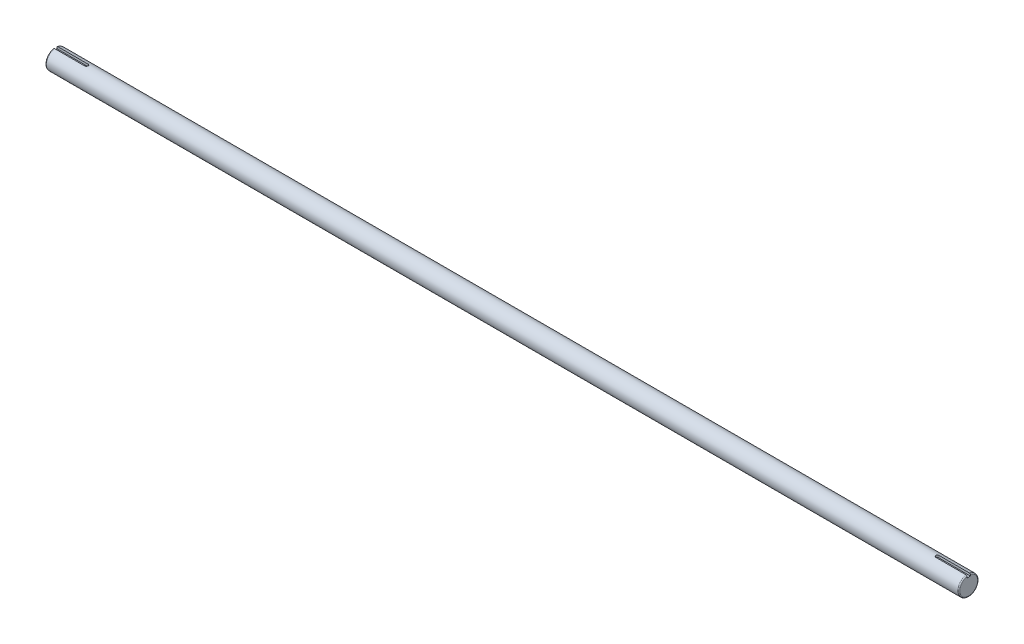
ISO-10303-21;
HEADER;
FILE_DESCRIPTION(('STEP AP214'),'2;1');
FILE_NAME('part.step','',(''),(''),'','','');
FILE_SCHEMA(('AUTOMOTIVE_DESIGN { 1 0 10303 214 1 1 1 1 }'));
ENDSEC;
DATA;
#1=APPLICATION_CONTEXT('core data for automotive mechanical design processes');
#2=APPLICATION_PROTOCOL_DEFINITION('international standard','automotive_design',2000,#1);
#3=PRODUCT_CONTEXT('',#1,'mechanical');
#4=PRODUCT('Part','Part','',(#3));
#5=PRODUCT_RELATED_PRODUCT_CATEGORY('part','',(#4));
#6=PRODUCT_DEFINITION_FORMATION('','',#4);
#7=PRODUCT_DEFINITION_CONTEXT('part definition',#1,'design');
#8=PRODUCT_DEFINITION('design','',#6,#7);
#9=PRODUCT_DEFINITION_SHAPE('','',#8);
#10=(LENGTH_UNIT() NAMED_UNIT(*) SI_UNIT(.MILLI.,.METRE.));
#11=(NAMED_UNIT(*) PLANE_ANGLE_UNIT() SI_UNIT($,.RADIAN.));
#12=(NAMED_UNIT(*) SI_UNIT($,.STERADIAN.) SOLID_ANGLE_UNIT());
#13=UNCERTAINTY_MEASURE_WITH_UNIT(LENGTH_MEASURE(1.E-05),#10,'distance_accuracy_value','');
#14=(GEOMETRIC_REPRESENTATION_CONTEXT(3) GLOBAL_UNCERTAINTY_ASSIGNED_CONTEXT((#13)) GLOBAL_UNIT_ASSIGNED_CONTEXT((#10,
#11,#12)) REPRESENTATION_CONTEXT('',''));
#15=CARTESIAN_POINT('',(0.,0.,0.));
#16=DIRECTION('',(0.,0.,1.));
#17=DIRECTION('',(1.,0.,0.));
#18=AXIS2_PLACEMENT_3D('',#15,#16,#17);
#19=CARTESIAN_POINT('',(353.06,0.,0.));
#20=DIRECTION('',(-1.,0.,0.));
#21=DIRECTION('',(0.,0.,1.));
#22=AXIS2_PLACEMENT_3D('',#19,#20,#21);
#23=CYLINDRICAL_SURFACE('',#22,7.62);
#24=DIRECTION('',(-1.,0.,0.));
#25=VECTOR('',#24,1.);
#26=CARTESIAN_POINT('',(353.06,7.51342132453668,1.26999999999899));
#27=LINE('',#26,#25);
#28=CARTESIAN_POINT('',(352.298,7.51342132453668,1.26999999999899));
#29=VERTEX_POINT('',#28);
#30=CARTESIAN_POINT('',(328.93,7.51342132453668,1.26999999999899));
#31=VERTEX_POINT('',#30);
#32=EDGE_CURVE('E64',#29,#31,#27,.T.);
#33=ORIENTED_EDGE('',*,*,#32,.T.);
#34=CARTESIAN_POINT('',(328.93,7.51342132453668,1.26999999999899));
#35=CARTESIAN_POINT('',(328.859197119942,7.51342260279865,1.26999715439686));
#36=CARTESIAN_POINT('',(328.788355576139,7.51443299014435,1.26405902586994));
#37=CARTESIAN_POINT('',(328.648660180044,7.51836168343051,1.24047373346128));
#38=CARTESIAN_POINT('',(328.579808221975,7.52128174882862,1.22281577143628));
#39=CARTESIAN_POINT('',(328.446133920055,7.52869009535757,1.17633980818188));
#40=CARTESIAN_POINT('',(328.381308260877,7.53317706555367,1.14753113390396));
#41=CARTESIAN_POINT('',(328.257417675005,7.54321210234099,1.07959474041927));
#42=CARTESIAN_POINT('',(328.198352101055,7.54876004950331,1.04046818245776));
#43=CARTESIAN_POINT('',(328.087069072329,7.56035303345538,0.95259526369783));
#44=CARTESIAN_POINT('',(328.034916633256,7.56640202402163,0.903767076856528));
#45=CARTESIAN_POINT('',(327.939505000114,7.57828040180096,0.798053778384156));
#46=CARTESIAN_POINT('',(327.896246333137,7.58410977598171,0.741168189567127));
#47=CARTESIAN_POINT('',(327.819606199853,7.59493394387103,0.620533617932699));
#48=CARTESIAN_POINT('',(327.786285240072,7.59992354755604,0.556745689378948));
#49=CARTESIAN_POINT('',(327.73085529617,7.6084619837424,0.424380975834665));
#50=CARTESIAN_POINT('',(327.708745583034,7.61201090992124,0.355804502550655));
#51=CARTESIAN_POINT('',(327.676564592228,7.61724021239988,0.216481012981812));
#52=CARTESIAN_POINT('',(327.66638407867,7.61893753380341,0.145759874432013));
#53=CARTESIAN_POINT('',(327.65801079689,7.62033060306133,0.00359424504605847));
#54=CARTESIAN_POINT('',(327.659817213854,7.62002648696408,-0.0678501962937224));
#55=CARTESIAN_POINT('',(327.675281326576,7.61746436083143,-0.208687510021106));
#56=CARTESIAN_POINT('',(327.688821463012,7.61522573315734,-0.278093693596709));
#57=CARTESIAN_POINT('',(327.727183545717,7.60906773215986,-0.413634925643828));
#58=CARTESIAN_POINT('',(327.752005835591,7.60514830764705,-0.479769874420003));
#59=CARTESIAN_POINT('',(327.81234444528,7.59603610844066,-0.60724092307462));
#60=CARTESIAN_POINT('',(327.847909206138,7.59083758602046,-0.668553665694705));
#61=CARTESIAN_POINT('',(327.928687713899,7.57974474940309,-0.784385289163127));
#62=CARTESIAN_POINT('',(327.973902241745,7.57385037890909,-0.838903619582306));
#63=CARTESIAN_POINT('',(328.073348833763,7.56193696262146,-0.940293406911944));
#64=CARTESIAN_POINT('',(328.12768364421,7.55591727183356,-0.987064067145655));
#65=CARTESIAN_POINT('',(328.24348224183,7.54450083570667,-1.07084093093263));
#66=CARTESIAN_POINT('',(328.304946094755,7.53910409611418,-1.10784704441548));
#67=CARTESIAN_POINT('',(328.433374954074,7.52954427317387,-1.17106417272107));
#68=CARTESIAN_POINT('',(328.500346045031,7.52538257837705,-1.19726304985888));
#69=CARTESIAN_POINT('',(328.637823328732,7.51878703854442,-1.23801117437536));
#70=CARTESIAN_POINT('',(328.708329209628,7.5163530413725,-1.25256144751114));
#71=CARTESIAN_POINT('',(328.84997280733,7.51351791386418,-1.26945739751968));
#72=CARTESIAN_POINT('',(328.921092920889,7.51309285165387,-1.27194676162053));
#73=CARTESIAN_POINT('',(329.062733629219,7.51425997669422,-1.2650331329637));
#74=CARTESIAN_POINT('',(329.133254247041,7.51585208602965,-1.25563059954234));
#75=CARTESIAN_POINT('',(329.271237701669,7.52085205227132,-1.22532258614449));
#76=CARTESIAN_POINT('',(329.338717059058,7.52424835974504,-1.20449024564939));
#77=CARTESIAN_POINT('',(329.46922684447,7.53246435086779,-1.15199068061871));
#78=CARTESIAN_POINT('',(329.532257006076,7.53728411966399,-1.12032280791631));
#79=CARTESIAN_POINT('',(329.652718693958,7.54785957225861,-1.04671199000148));
#80=CARTESIAN_POINT('',(329.71009321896,7.55362347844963,-1.00467696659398));
#81=CARTESIAN_POINT('',(329.817025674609,7.5654137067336,-0.91165144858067));
#82=CARTESIAN_POINT('',(329.866583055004,7.57144004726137,-0.860660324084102));
#83=CARTESIAN_POINT('',(329.956999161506,7.58315182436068,-0.750533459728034));
#84=CARTESIAN_POINT('',(329.997762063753,7.58883306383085,-0.691318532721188));
#85=CARTESIAN_POINT('',(330.068760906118,7.59914717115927,-0.566797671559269));
#86=CARTESIAN_POINT('',(330.098997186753,7.60378007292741,-0.501491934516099));
#87=CARTESIAN_POINT('',(330.147935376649,7.61145725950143,-0.366927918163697));
#88=CARTESIAN_POINT('',(330.166687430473,7.61450844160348,-0.297688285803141));
#89=CARTESIAN_POINT('',(330.192286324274,7.61870756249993,-0.156987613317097));
#90=CARTESIAN_POINT('',(330.199134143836,7.61985565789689,-0.0855267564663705));
#91=CARTESIAN_POINT('',(330.200701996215,7.62011703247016,0.0566629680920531));
#92=CARTESIAN_POINT('',(330.195567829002,7.61925477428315,0.127390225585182));
#93=CARTESIAN_POINT('',(330.173632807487,7.61564226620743,0.266960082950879));
#94=CARTESIAN_POINT('',(330.156832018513,7.61289202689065,0.335802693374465));
#95=CARTESIAN_POINT('',(330.112096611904,7.60581150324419,0.46959339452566));
#96=CARTESIAN_POINT('',(330.084174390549,7.60148297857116,0.534545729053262));
#97=CARTESIAN_POINT('',(330.018004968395,7.59171840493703,0.658866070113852));
#98=CARTESIAN_POINT('',(329.979757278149,7.58628230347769,0.718233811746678));
#99=CARTESIAN_POINT('',(329.893505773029,7.57482675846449,0.830434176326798));
#100=CARTESIAN_POINT('',(329.845395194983,7.56880134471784,0.883184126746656));
#101=CARTESIAN_POINT('',(329.741007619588,7.55688762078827,0.979913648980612));
#102=CARTESIAN_POINT('',(329.684728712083,7.55099934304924,1.02389116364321));
#103=CARTESIAN_POINT('',(329.565129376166,7.53998158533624,1.10211324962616));
#104=CARTESIAN_POINT('',(329.501761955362,7.53485776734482,1.13628677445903));
#105=CARTESIAN_POINT('',(329.370126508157,7.52601598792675,1.19345178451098));
#106=CARTESIAN_POINT('',(329.30186345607,7.52229662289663,1.21645444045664));
#107=CARTESIAN_POINT('',(329.182778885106,7.51750970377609,1.24562923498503));
#108=CARTESIAN_POINT('',(329.132678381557,7.51598508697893,1.25475360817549));
#109=CARTESIAN_POINT('',(329.031725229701,7.51394044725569,1.26693995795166));
#110=CARTESIAN_POINT('',(328.980872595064,7.51342040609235,1.27000204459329));
#111=CARTESIAN_POINT('',(328.93,7.51342132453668,1.26999999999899));
#112=B_SPLINE_CURVE_WITH_KNOTS('',3,(#34,#35,#36,#37,#38,#39,#40,#41,#42,#43,#44,#45,#46,#47,
#48,#49,#50,#51,#52,#53,#54,#55,#56,#57,#58,#59,#60,#61,#62,#63,#64,#65,#66,#67,#68,#69,#70,#71,
#72,#73,#74,#75,#76,#77,#78,#79,#80,#81,#82,#83,#84,#85,#86,#87,#88,#89,#90,#91,#92,#93,#94,#95,
#96,#97,#98,#99,#100,#101,#102,#103,#104,#105,#106,#107,#108,#109,#110,#111),.UNSPECIFIED.,.T.,
.F.,(4,2,2,2,2,2,2,2,2,2,2,2,2,2,2,2,2,2,2,2,2,2,2,2,2,2,2,2,2,2,2,2,2,2,2,2,2,2,4),(0.,
0.212222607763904,0.424641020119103,0.636882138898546,0.849099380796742,1.06318892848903,
1.27729116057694,1.49267153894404,1.70803791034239,1.92141636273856,2.13478031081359,
2.34603097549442,2.55728807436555,2.76951238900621,2.98175388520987,3.1965703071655,
3.41138871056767,3.62644772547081,3.84148780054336,4.05395959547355,4.2664231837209,
4.47754280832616,4.6886750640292,4.90175470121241,5.11484933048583,5.33016009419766,
5.54546389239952,5.75982076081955,5.97415998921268,6.18590470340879,6.39764823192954,
6.60915640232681,6.82067460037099,7.03461634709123,7.24860820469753,7.46411373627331,
7.67940331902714,7.83189020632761,7.98437432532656),.UNSPECIFIED.);
#113=CARTESIAN_POINT('',(328.93,7.51342132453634,-1.27000000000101));
#114=VERTEX_POINT('',#113);
#115=EDGE_CURVE('E13',#31,#114,#112,.T.);
#116=ORIENTED_EDGE('',*,*,#115,.T.);
#117=DIRECTION('',(-1.,0.,0.));
#118=VECTOR('',#117,1.);
#119=CARTESIAN_POINT('',(353.06,7.51342132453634,-1.27000000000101));
#120=LINE('',#119,#118);
#121=CARTESIAN_POINT('',(352.298,7.51342132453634,-1.27000000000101));
#122=VERTEX_POINT('',#121);
#123=EDGE_CURVE('E157',#114,#122,#120,.F.);
#124=ORIENTED_EDGE('',*,*,#123,.T.);
#125=CARTESIAN_POINT('',(352.298,0.,0.));
#126=DIRECTION('',(1.,0.,0.));
#127=DIRECTION('',(0.,0.,-1.));
#128=AXIS2_PLACEMENT_3D('',#125,#126,#127);
#129=CIRCLE('',#128,7.62);
#130=EDGE_CURVE('E191',#122,#29,#129,.F.);
#131=ORIENTED_EDGE('',*,*,#130,.T.);
#132=EDGE_LOOP('',(#33,#116,#124,#131));
#133=FACE_BOUND('',#132,.T.);
#134=DIRECTION('',(-1.,0.,0.));
#135=VECTOR('',#134,1.);
#136=CARTESIAN_POINT('',(353.06,7.51342132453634,-1.270000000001));
#137=LINE('',#136,#135);
#138=CARTESIAN_POINT('',(-352.298,7.51342132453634,-1.27000000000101));
#139=VERTEX_POINT('',#138);
#140=CARTESIAN_POINT('',(-328.93,7.51342132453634,-1.27000000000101));
#141=VERTEX_POINT('',#140);
#142=EDGE_CURVE('E72',#139,#141,#137,.F.);
#143=ORIENTED_EDGE('',*,*,#142,.T.);
#144=CARTESIAN_POINT('',(-328.93,7.51342132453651,1.27));
#145=CARTESIAN_POINT('',(-329.000802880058,7.51342260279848,1.26999715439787));
#146=CARTESIAN_POINT('',(-329.071644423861,7.51443299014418,1.26405902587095));
#147=CARTESIAN_POINT('',(-329.211339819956,7.51836168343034,1.24047373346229));
#148=CARTESIAN_POINT('',(-329.280191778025,7.52128174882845,1.2228157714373));
#149=CARTESIAN_POINT('',(-329.413866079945,7.52869009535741,1.1763398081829));
#150=CARTESIAN_POINT('',(-329.478691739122,7.53317706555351,1.14753113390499));
#151=CARTESIAN_POINT('',(-329.602582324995,7.54321210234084,1.07959474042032));
#152=CARTESIAN_POINT('',(-329.661647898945,7.54876004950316,1.04046818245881));
#153=CARTESIAN_POINT('',(-329.772930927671,7.56035303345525,0.952595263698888));
#154=CARTESIAN_POINT('',(-329.825083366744,7.56640202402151,0.903767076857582));
#155=CARTESIAN_POINT('',(-329.920494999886,7.57828040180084,0.798053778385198));
#156=CARTESIAN_POINT('',(-329.963753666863,7.58410977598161,0.74116818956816));
#157=CARTESIAN_POINT('',(-330.040393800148,7.59493394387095,0.620533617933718));
#158=CARTESIAN_POINT('',(-330.073714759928,7.59992354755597,0.556745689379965));
#159=CARTESIAN_POINT('',(-330.12914470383,7.60846198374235,0.424380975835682));
#160=CARTESIAN_POINT('',(-330.151254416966,7.61201090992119,0.355804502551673));
#161=CARTESIAN_POINT('',(-330.183435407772,7.61724021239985,0.21648101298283));
#162=CARTESIAN_POINT('',(-330.19361592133,7.6189375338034,0.145759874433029));
#163=CARTESIAN_POINT('',(-330.20198920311,7.62033060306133,0.00359424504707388));
#164=CARTESIAN_POINT('',(-330.200182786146,7.62002648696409,-0.0678501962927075));
#165=CARTESIAN_POINT('',(-330.184718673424,7.61746436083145,-0.208687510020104));
#166=CARTESIAN_POINT('',(-330.171178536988,7.61522573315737,-0.278093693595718));
#167=CARTESIAN_POINT('',(-330.132816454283,7.60906773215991,-0.413634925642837));
#168=CARTESIAN_POINT('',(-330.107994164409,7.60514830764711,-0.479769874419));
#169=CARTESIAN_POINT('',(-330.04765555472,7.59603610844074,-0.607240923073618));
#170=CARTESIAN_POINT('',(-330.012090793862,7.59083758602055,-0.668553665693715));
#171=CARTESIAN_POINT('',(-329.931312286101,7.5797447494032,-0.784385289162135));
#172=CARTESIAN_POINT('',(-329.886097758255,7.5738503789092,-0.838903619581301));
#173=CARTESIAN_POINT('',(-329.786651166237,7.56193696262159,-0.940293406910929));
#174=CARTESIAN_POINT('',(-329.73231635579,7.55591727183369,-0.987064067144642));
#175=CARTESIAN_POINT('',(-329.61651775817,7.54450083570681,-1.07084093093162));
#176=CARTESIAN_POINT('',(-329.555053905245,7.53910409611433,-1.10784704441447));
#177=CARTESIAN_POINT('',(-329.426625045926,7.52954427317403,-1.17106417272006));
#178=CARTESIAN_POINT('',(-329.359653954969,7.52538257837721,-1.19726304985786));
#179=CARTESIAN_POINT('',(-329.222176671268,7.51878703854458,-1.23801117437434));
#180=CARTESIAN_POINT('',(-329.151670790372,7.51635304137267,-1.25256144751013));
#181=CARTESIAN_POINT('',(-329.01002719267,7.51351791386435,-1.26945739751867));
#182=CARTESIAN_POINT('',(-328.938907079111,7.51309285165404,-1.27194676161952));
#183=CARTESIAN_POINT('',(-328.797266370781,7.51425997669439,-1.26503313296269));
#184=CARTESIAN_POINT('',(-328.726745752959,7.51585208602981,-1.25563059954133));
#185=CARTESIAN_POINT('',(-328.588762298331,7.52085205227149,-1.22532258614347));
#186=CARTESIAN_POINT('',(-328.521282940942,7.52424835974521,-1.20449024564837));
#187=CARTESIAN_POINT('',(-328.39077315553,7.53246435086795,-1.15199068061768));
#188=CARTESIAN_POINT('',(-328.327742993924,7.53728411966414,-1.12032280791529));
#189=CARTESIAN_POINT('',(-328.207281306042,7.54785957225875,-1.04671199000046));
#190=CARTESIAN_POINT('',(-328.14990678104,7.55362347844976,-1.00467696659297));
#191=CARTESIAN_POINT('',(-328.042974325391,7.56541370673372,-0.911651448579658));
#192=CARTESIAN_POINT('',(-327.993416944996,7.57144004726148,-0.860660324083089));
#193=CARTESIAN_POINT('',(-327.903000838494,7.58315182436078,-0.75053345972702));
#194=CARTESIAN_POINT('',(-327.862237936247,7.58883306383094,-0.691318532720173));
#195=CARTESIAN_POINT('',(-327.791239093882,7.59914717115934,-0.566797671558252));
#196=CARTESIAN_POINT('',(-327.761002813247,7.60378007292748,-0.501491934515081));
#197=CARTESIAN_POINT('',(-327.712064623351,7.61145725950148,-0.366927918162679));
#198=CARTESIAN_POINT('',(-327.693312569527,7.61450844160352,-0.297688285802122));
#199=CARTESIAN_POINT('',(-327.667713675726,7.61870756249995,-0.156987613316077));
#200=CARTESIAN_POINT('',(-327.660865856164,7.6198556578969,-0.0855267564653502));
#201=CARTESIAN_POINT('',(-327.659298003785,7.62011703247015,0.0566629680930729));
#202=CARTESIAN_POINT('',(-327.664432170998,7.61925477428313,0.127390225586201));
#203=CARTESIAN_POINT('',(-327.686367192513,7.61564226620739,0.266960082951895));
#204=CARTESIAN_POINT('',(-327.703167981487,7.61289202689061,0.335802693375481));
#205=CARTESIAN_POINT('',(-327.747903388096,7.60581150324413,0.469593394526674));
#206=CARTESIAN_POINT('',(-327.775825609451,7.60148297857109,0.534545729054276));
#207=CARTESIAN_POINT('',(-327.841995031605,7.59171840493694,0.658866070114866));
#208=CARTESIAN_POINT('',(-327.880242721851,7.58628230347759,0.718233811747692));
#209=CARTESIAN_POINT('',(-327.966494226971,7.57482675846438,0.830434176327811));
#210=CARTESIAN_POINT('',(-328.014604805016,7.56880134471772,0.883184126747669));
#211=CARTESIAN_POINT('',(-328.118992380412,7.55688762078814,0.979913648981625));
#212=CARTESIAN_POINT('',(-328.175271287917,7.5509993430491,1.02389116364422));
#213=CARTESIAN_POINT('',(-328.294870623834,7.53998158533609,1.10211324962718));
#214=CARTESIAN_POINT('',(-328.358238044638,7.53485776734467,1.13628677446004));
#215=CARTESIAN_POINT('',(-328.489873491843,7.52601598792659,1.19345178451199));
#216=CARTESIAN_POINT('',(-328.55813654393,7.52229662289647,1.21645444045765));
#217=CARTESIAN_POINT('',(-328.677221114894,7.51750970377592,1.24562923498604));
#218=CARTESIAN_POINT('',(-328.727321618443,7.51598508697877,1.2547536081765));
#219=CARTESIAN_POINT('',(-328.828274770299,7.51394044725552,1.26693995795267));
#220=CARTESIAN_POINT('',(-328.879127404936,7.51342040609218,1.2700020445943));
#221=CARTESIAN_POINT('',(-328.93,7.51342132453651,1.27));
#222=B_SPLINE_CURVE_WITH_KNOTS('',3,(#144,#145,#146,#147,#148,#149,#150,#151,#152,#153,#154,
#155,#156,#157,#158,#159,#160,#161,#162,#163,#164,#165,#166,#167,#168,#169,#170,#171,#172,#173,
#174,#175,#176,#177,#178,#179,#180,#181,#182,#183,#184,#185,#186,#187,#188,#189,#190,#191,#192,
#193,#194,#195,#196,#197,#198,#199,#200,#201,#202,#203,#204,#205,#206,#207,#208,#209,#210,#211,
#212,#213,#214,#215,#216,#217,#218,#219,#220,#221),.UNSPECIFIED.,.T.,.F.,(4,2,2,2,2,2,2,2,2,2,2,
2,2,2,2,2,2,2,2,2,2,2,2,2,2,2,2,2,2,2,2,2,2,2,2,2,2,2,4),(0.,0.212222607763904,
0.424641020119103,0.636882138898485,0.849099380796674,1.06318892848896,1.27729116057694,
1.49267153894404,1.70803791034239,1.92141636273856,2.1347803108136,2.34603097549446,
2.55728807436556,2.76951238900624,2.98175388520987,3.19657030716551,3.41138871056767,
3.62644772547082,3.84148780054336,4.05395959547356,4.2664231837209,4.47754280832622,
4.6886750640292,4.90175470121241,5.11484933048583,5.33016009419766,5.54546389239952,
5.75982076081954,5.97415998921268,6.18590470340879,6.39764823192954,6.60915640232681,
6.82067460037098,7.03461634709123,7.24860820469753,7.46411373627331,7.67940331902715,
7.83189020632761,7.98437432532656),.UNSPECIFIED.);
#223=CARTESIAN_POINT('',(-328.93,7.51342132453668,1.26999999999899));
#224=VERTEX_POINT('',#223);
#225=EDGE_CURVE('E222',#141,#224,#222,.T.);
#226=ORIENTED_EDGE('',*,*,#225,.T.);
#227=DIRECTION('',(-1.,0.,0.));
#228=VECTOR('',#227,1.);
#229=CARTESIAN_POINT('',(353.06,7.51342132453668,1.26999999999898));
#230=LINE('',#229,#228);
#231=CARTESIAN_POINT('',(-352.298,7.51342132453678,1.26999999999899));
#232=VERTEX_POINT('',#231);
#233=EDGE_CURVE('E182',#224,#232,#230,.T.);
#234=ORIENTED_EDGE('',*,*,#233,.T.);
#235=CARTESIAN_POINT('',(-352.298,0.,0.));
#236=DIRECTION('',(1.,0.,0.));
#237=DIRECTION('',(0.,0.,-1.));
#238=AXIS2_PLACEMENT_3D('',#235,#236,#237);
#239=CIRCLE('',#238,7.62);
#240=EDGE_CURVE('E188',#232,#139,#239,.T.);
#241=ORIENTED_EDGE('',*,*,#240,.T.);
#242=EDGE_LOOP('',(#143,#226,#234,#241));
#243=FACE_BOUND('',#242,.T.);
#244=ADVANCED_FACE('F44',(#133,#243),#23,.T.);
#245=CARTESIAN_POINT('',(353.06,0.,0.));
#246=DIRECTION('',(1.,0.,0.));
#247=DIRECTION('',(0.,0.,-1.));
#248=AXIS2_PLACEMENT_3D('',#245,#246,#247);
#249=PLANE('',#248);
#250=DIRECTION('',(0.,1.,0.));
#251=VECTOR('',#250,1.);
#252=CARTESIAN_POINT('',(353.06,5.8039,-1.27000000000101));
#253=LINE('',#252,#251);
#254=CARTESIAN_POINT('',(353.06,5.8039,-1.27000000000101));
#255=VERTEX_POINT('',#254);
#256=CARTESIAN_POINT('',(353.06,6.73938157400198,-1.27000000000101));
#257=VERTEX_POINT('',#256);
#258=EDGE_CURVE('E153',#255,#257,#253,.T.);
#259=ORIENTED_EDGE('',*,*,#258,.F.);
#260=DIRECTION('',(0.,0.,-1.));
#261=VECTOR('',#260,1.);
#262=CARTESIAN_POINT('',(353.06,5.8039,1.26999999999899));
#263=LINE('',#262,#261);
#264=CARTESIAN_POINT('',(353.06,5.8039,1.26999999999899));
#265=VERTEX_POINT('',#264);
#266=EDGE_CURVE('E143',#265,#255,#263,.T.);
#267=ORIENTED_EDGE('',*,*,#266,.F.);
#268=DIRECTION('',(0.,1.,0.));
#269=VECTOR('',#268,1.);
#270=CARTESIAN_POINT('',(353.06,5.8039,1.26999999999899));
#271=LINE('',#270,#269);
#272=CARTESIAN_POINT('',(353.06,6.73938157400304,1.26999999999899));
#273=VERTEX_POINT('',#272);
#274=EDGE_CURVE('E134',#265,#273,#271,.T.);
#275=ORIENTED_EDGE('',*,*,#274,.T.);
#276=CARTESIAN_POINT('',(353.06,0.,0.));
#277=DIRECTION('',(1.,0.,0.));
#278=DIRECTION('',(0.,0.,-1.));
#279=AXIS2_PLACEMENT_3D('',#276,#277,#278);
#280=CIRCLE('',#279,6.858);
#281=EDGE_CURVE('E185',#273,#257,#280,.T.);
#282=ORIENTED_EDGE('',*,*,#281,.T.);
#283=EDGE_LOOP('',(#259,#267,#275,#282));
#284=FACE_BOUND('',#283,.T.);
#285=ADVANCED_FACE('F220',(#284),#249,.T.);
#286=CARTESIAN_POINT('',(-353.06,0.,0.));
#287=DIRECTION('',(1.,0.,0.));
#288=DIRECTION('',(0.,0.,-1.));
#289=AXIS2_PLACEMENT_3D('',#286,#287,#288);
#290=PLANE('',#289);
#291=CARTESIAN_POINT('',(-353.06,0.,0.));
#292=DIRECTION('',(1.,0.,0.));
#293=DIRECTION('',(0.,0.,-1.));
#294=AXIS2_PLACEMENT_3D('',#291,#292,#293);
#295=CIRCLE('',#294,6.858);
#296=CARTESIAN_POINT('',(-353.06,6.73938157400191,-1.27000000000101));
#297=VERTEX_POINT('',#296);
#298=CARTESIAN_POINT('',(-353.06,6.73938157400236,1.26999999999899));
#299=VERTEX_POINT('',#298);
#300=EDGE_CURVE('E194',#297,#299,#295,.F.);
#301=ORIENTED_EDGE('',*,*,#300,.T.);
#302=DIRECTION('',(0.,1.,0.));
#303=VECTOR('',#302,1.);
#304=CARTESIAN_POINT('',(-353.06,5.8039,1.26999999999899));
#305=LINE('',#304,#303);
#306=CARTESIAN_POINT('',(-353.06,5.8039,1.26999999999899));
#307=VERTEX_POINT('',#306);
#308=EDGE_CURVE('E175',#307,#299,#305,.T.);
#309=ORIENTED_EDGE('',*,*,#308,.F.);
#310=DIRECTION('',(0.,0.,1.));
#311=VECTOR('',#310,1.);
#312=CARTESIAN_POINT('',(-353.06,5.8039,1.26999999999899));
#313=LINE('',#312,#311);
#314=CARTESIAN_POINT('',(-353.06,5.8039,-1.27000000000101));
#315=VERTEX_POINT('',#314);
#316=EDGE_CURVE('E166',#315,#307,#313,.T.);
#317=ORIENTED_EDGE('',*,*,#316,.F.);
#318=DIRECTION('',(0.,1.,0.));
#319=VECTOR('',#318,1.);
#320=CARTESIAN_POINT('',(-353.06,5.8039,-1.27000000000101));
#321=LINE('',#320,#319);
#322=EDGE_CURVE('E177',#315,#297,#321,.T.);
#323=ORIENTED_EDGE('',*,*,#322,.T.);
#324=EDGE_LOOP('',(#301,#309,#317,#323));
#325=FACE_BOUND('',#324,.T.);
#326=ADVANCED_FACE('F234',(#325),#290,.F.);
#327=CARTESIAN_POINT('',(352.298,0.,0.));
#328=DIRECTION('',(1.,0.,0.));
#329=DIRECTION('',(0.,0.,-1.));
#330=AXIS2_PLACEMENT_3D('',#327,#328,#329);
#331=TOROIDAL_SURFACE('',#330,6.858,0.762);
#332=CARTESIAN_POINT('',(352.499936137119,5.99009365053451,-1.27000000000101));
#333=CARTESIAN_POINT('',(352.541005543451,6.00163403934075,-1.27000000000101));
#334=CARTESIAN_POINT('',(352.581119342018,6.0167003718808,-1.27000000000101));
#335=CARTESIAN_POINT('',(352.658260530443,6.05340452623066,-1.27000000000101));
#336=CARTESIAN_POINT('',(352.695283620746,6.07505131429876,-1.27000000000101));
#337=CARTESIAN_POINT('',(352.765142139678,6.12420082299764,-1.27000000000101));
#338=CARTESIAN_POINT('',(352.797982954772,6.15169588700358,-1.27000000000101));
#339=CARTESIAN_POINT('',(352.858655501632,6.21172663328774,-1.27000000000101));
#340=CARTESIAN_POINT('',(352.88648835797,6.24426118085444,-1.27000000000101));
#341=CARTESIAN_POINT('',(352.936819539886,6.31395715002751,-1.27000000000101));
#342=CARTESIAN_POINT('',(352.959233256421,6.35117966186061,-1.27000000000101));
#343=CARTESIAN_POINT('',(352.997619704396,6.42881154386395,-1.27000000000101));
#344=CARTESIAN_POINT('',(353.01359156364,6.46922134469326,-1.27000000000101));
#345=CARTESIAN_POINT('',(353.038908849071,6.55283855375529,-1.27000000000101));
#346=CARTESIAN_POINT('',(353.048133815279,6.59608246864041,-1.27000000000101));
#347=CARTESIAN_POINT('',(353.059251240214,6.68350392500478,-1.27000000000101));
#348=CARTESIAN_POINT('',(353.061143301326,6.72768151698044,-1.27000000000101));
#349=CARTESIAN_POINT('',(353.057518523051,6.81605200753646,-1.27000000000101));
#350=CARTESIAN_POINT('',(353.051948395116,6.86024273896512,-1.27000000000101));
#351=CARTESIAN_POINT('',(353.033433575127,6.94705295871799,-1.27000000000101));
#352=CARTESIAN_POINT('',(353.020488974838,6.9896724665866,-1.27000000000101));
#353=CARTESIAN_POINT('',(352.987631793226,7.07190496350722,-1.27000000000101));
#354=CARTESIAN_POINT('',(352.967752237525,7.11153113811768,-1.27000000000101));
#355=CARTESIAN_POINT('',(352.921539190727,7.18682401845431,-1.27000000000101));
#356=CARTESIAN_POINT('',(352.895206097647,7.22249096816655,-1.27000000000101));
#357=CARTESIAN_POINT('',(352.837189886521,7.28835412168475,-1.27000000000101));
#358=CARTESIAN_POINT('',(352.805580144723,7.31861494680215,-1.27000000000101));
#359=CARTESIAN_POINT('',(352.737661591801,7.37330179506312,-1.27000000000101));
#360=CARTESIAN_POINT('',(352.701353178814,7.39772831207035,-1.27000000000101));
#361=CARTESIAN_POINT('',(352.625655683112,7.43966837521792,-1.27000000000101));
#362=CARTESIAN_POINT('',(352.586321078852,7.45728026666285,-1.27000000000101));
#363=CARTESIAN_POINT('',(352.505230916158,7.48556257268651,-1.27000000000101));
#364=CARTESIAN_POINT('',(352.46347553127,7.49623348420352,-1.27000000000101));
#365=CARTESIAN_POINT('',(352.379246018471,7.51022012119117,-1.27000000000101));
#366=CARTESIAN_POINT('',(352.336785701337,7.51361911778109,-1.27000000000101));
#367=CARTESIAN_POINT('',(352.251901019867,7.51320573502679,-1.27000000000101));
#368=CARTESIAN_POINT('',(352.209476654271,7.50939361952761,-1.27000000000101));
#369=CARTESIAN_POINT('',(352.12606105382,7.49470813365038,-1.27000000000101));
#370=CARTESIAN_POINT('',(352.085064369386,7.48386567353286,-1.27000000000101));
#371=CARTESIAN_POINT('',(352.00546272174,7.45547807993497,-1.27000000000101));
#372=CARTESIAN_POINT('',(351.966857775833,7.43793289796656,-1.27000000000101));
#373=CARTESIAN_POINT('',(351.892961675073,7.39658216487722,-1.27000000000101));
#374=CARTESIAN_POINT('',(351.857684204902,7.37275217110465,-1.27000000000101));
#375=CARTESIAN_POINT('',(351.79157529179,7.31956798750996,-1.27000000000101));
#376=CARTESIAN_POINT('',(351.760744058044,7.29021353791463,-1.27000000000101));
#377=CARTESIAN_POINT('',(351.704030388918,7.22647565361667,-1.27000000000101));
#378=CARTESIAN_POINT('',(351.678206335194,7.19204028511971,-1.27000000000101));
#379=CARTESIAN_POINT('',(351.632607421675,7.11937475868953,-1.27000000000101));
#380=CARTESIAN_POINT('',(351.612833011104,7.08114431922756,-1.27000000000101));
#381=CARTESIAN_POINT('',(351.579585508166,7.00137168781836,-1.27000000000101));
#382=CARTESIAN_POINT('',(351.566209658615,6.95978896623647,-1.27000000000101));
#383=CARTESIAN_POINT('',(351.546526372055,6.87498304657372,-1.27000000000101));
#384=CARTESIAN_POINT('',(351.540219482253,6.83175972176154,-1.27000000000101));
#385=CARTESIAN_POINT('',(351.534782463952,6.74428411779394,-1.27000000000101));
#386=CARTESIAN_POINT('',(351.535749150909,6.70002580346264,-1.27000000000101));
#387=CARTESIAN_POINT('',(351.545050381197,6.61228880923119,-1.27000000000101));
#388=CARTESIAN_POINT('',(351.553385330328,6.56881017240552,-1.27000000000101));
#389=CARTESIAN_POINT('',(351.577272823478,6.48359681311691,-1.27000000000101));
#390=CARTESIAN_POINT('',(351.592868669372,6.44187421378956,-1.27000000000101));
#391=CARTESIAN_POINT('',(351.630881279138,6.36165863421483,-1.27000000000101));
#392=CARTESIAN_POINT('',(351.653297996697,6.32316563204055,-1.27000000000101));
#393=CARTESIAN_POINT('',(351.704211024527,6.25075568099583,-1.27000000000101));
#394=CARTESIAN_POINT('',(351.732672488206,6.21681424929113,-1.27000000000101));
#395=CARTESIAN_POINT('',(351.794976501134,6.15429337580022,-1.27000000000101));
#396=CARTESIAN_POINT('',(351.828818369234,6.12571325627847,-1.27000000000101));
#397=CARTESIAN_POINT('',(351.900320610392,6.07525539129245,-1.27000000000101));
#398=CARTESIAN_POINT('',(351.937906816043,6.0532725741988,-1.27000000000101));
#399=CARTESIAN_POINT('',(352.016304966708,6.01607599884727,-1.27000000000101));
#400=CARTESIAN_POINT('',(352.057117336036,6.00086313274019,-1.27000000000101));
#401=CARTESIAN_POINT('',(352.139920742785,5.97795340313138,-1.27000000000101));
#402=CARTESIAN_POINT('',(352.181872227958,5.97011315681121,-1.27000000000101));
#403=CARTESIAN_POINT('',(352.266460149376,5.96170030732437,-1.27000000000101));
#404=CARTESIAN_POINT('',(352.309095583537,5.96111789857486,-1.27000000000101));
#405=CARTESIAN_POINT('',(352.376546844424,5.96596236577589,-1.27000000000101));
#406=CARTESIAN_POINT('',(352.401554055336,5.96904037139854,-1.27000000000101));
#407=CARTESIAN_POINT('',(352.451130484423,5.97770084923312,-1.27000000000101));
#408=CARTESIAN_POINT('',(352.475699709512,5.98328328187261,-1.27000000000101));
#409=CARTESIAN_POINT('',(352.499936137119,5.99009365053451,-1.27000000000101));
#410=B_SPLINE_CURVE_WITH_KNOTS('',3,(#332,#333,#334,#335,#336,#337,#338,#339,#340,#341,#342,
#343,#344,#345,#346,#347,#348,#349,#350,#351,#352,#353,#354,#355,#356,#357,#358,#359,#360,#361,
#362,#363,#364,#365,#366,#367,#368,#369,#370,#371,#372,#373,#374,#375,#376,#377,#378,#379,#380,
#381,#382,#383,#384,#385,#386,#387,#388,#389,#390,#391,#392,#393,#394,#395,#396,#397,#398,#399,
#400,#401,#402,#403,#404,#405,#406,#407,#408,#409),.UNSPECIFIED.,.T.,.F.,(4,2,2,2,2,2,2,2,2,2,2,
2,2,2,2,2,2,2,2,2,2,2,2,2,2,2,2,2,2,2,2,2,2,2,2,2,2,2,4),(0.,0.127885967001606,
0.255946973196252,0.38384134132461,0.511706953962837,0.641455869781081,0.771222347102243,
0.9032526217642,1.03529005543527,1.16827543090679,1.30125915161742,1.43361803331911,
1.56596875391,1.6966126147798,1.82724541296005,1.95591561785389,2.08457660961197,
2.21175623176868,2.33893120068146,2.46555077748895,2.59217127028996,2.71929166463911,
2.8464180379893,2.97494764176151,3.10348678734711,3.2339218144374,3.36436693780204,
3.49655140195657,3.62874314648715,3.76173354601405,3.89472304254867,4.02696574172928,
4.15919171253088,4.28918388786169,4.4191931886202,4.54661833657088,4.67387131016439,
4.74934228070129,4.82481205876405),.UNSPECIFIED.);
#411=EDGE_CURVE('E57',#257,#122,#410,.T.);
#412=ORIENTED_EDGE('',*,*,#411,.F.);
#413=ORIENTED_EDGE('',*,*,#281,.F.);
#414=CARTESIAN_POINT('',(352.499936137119,5.99009365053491,1.26999999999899));
#415=CARTESIAN_POINT('',(352.45956062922,5.97875238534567,1.26999999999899));
#416=CARTESIAN_POINT('',(352.418202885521,5.97080178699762,1.26999999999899));
#417=CARTESIAN_POINT('',(352.334708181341,5.96196080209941,1.26999999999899));
#418=CARTESIAN_POINT('',(352.292570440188,5.9610779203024,1.26999999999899));
#419=CARTESIAN_POINT('',(352.208763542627,5.96641281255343,1.26999999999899));
#420=CARTESIAN_POINT('',(352.167094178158,5.97262729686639,1.26999999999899));
#421=CARTESIAN_POINT('',(352.085397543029,5.99194916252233,1.26999999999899));
#422=CARTESIAN_POINT('',(352.045369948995,6.00505517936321,1.26999999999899));
#423=CARTESIAN_POINT('',(351.967967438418,6.03777991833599,1.26999999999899));
#424=CARTESIAN_POINT('',(351.930598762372,6.05741338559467,1.26999999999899));
#425=CARTESIAN_POINT('',(351.859617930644,6.10258227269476,1.26999999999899));
#426=CARTESIAN_POINT('',(351.826006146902,6.12811827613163,1.26999999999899));
#427=CARTESIAN_POINT('',(351.762915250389,6.18478617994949,1.26999999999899));
#428=CARTESIAN_POINT('',(351.733509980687,6.21600026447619,1.26999999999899));
#429=CARTESIAN_POINT('',(351.680231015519,6.28283687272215,1.26999999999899));
#430=CARTESIAN_POINT('',(351.65635789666,6.31845985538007,1.26999999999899));
#431=CARTESIAN_POINT('',(351.614318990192,6.39387683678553,1.26999999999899));
#432=CARTESIAN_POINT('',(351.596278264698,6.43374056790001,1.26999999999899));
#433=CARTESIAN_POINT('',(351.567036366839,6.51590264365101,1.26999999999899));
#434=CARTESIAN_POINT('',(351.555835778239,6.55820119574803,1.26999999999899));
#435=CARTESIAN_POINT('',(351.540453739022,6.64468615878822,1.26999999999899));
#436=CARTESIAN_POINT('',(351.536375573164,6.68889097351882,1.26999999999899));
#437=CARTESIAN_POINT('',(351.535674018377,6.77736117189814,1.26999999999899));
#438=CARTESIAN_POINT('',(351.539050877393,6.82162655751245,1.26999999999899));
#439=CARTESIAN_POINT('',(351.553208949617,6.90908866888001,1.26999999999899));
#440=CARTESIAN_POINT('',(351.564011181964,6.9522819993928,1.26999999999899));
#441=CARTESIAN_POINT('',(351.592773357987,7.03621769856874,1.26999999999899));
#442=CARTESIAN_POINT('',(351.610733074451,7.07696014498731,1.26999999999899));
#443=CARTESIAN_POINT('',(351.653161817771,7.15446834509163,1.26999999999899));
#444=CARTESIAN_POINT('',(351.677576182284,7.19126400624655,1.26999999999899));
#445=CARTESIAN_POINT('',(351.732319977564,7.26015671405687,1.26999999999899));
#446=CARTESIAN_POINT('',(351.762648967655,7.29225411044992,1.26999999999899));
#447=CARTESIAN_POINT('',(351.827896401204,7.35034361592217,1.26999999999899));
#448=CARTESIAN_POINT('',(351.862742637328,7.37641682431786,1.26999999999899));
#449=CARTESIAN_POINT('',(351.936369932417,7.42224209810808,1.26999999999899));
#450=CARTESIAN_POINT('',(351.975150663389,7.44199468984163,1.26999999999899));
#451=CARTESIAN_POINT('',(352.054946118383,7.47432801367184,1.26999999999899));
#452=CARTESIAN_POINT('',(352.095920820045,7.48700755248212,1.26999999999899));
#453=CARTESIAN_POINT('',(352.179426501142,7.50523524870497,1.26999999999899));
#454=CARTESIAN_POINT('',(352.221957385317,7.51078384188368,1.26999999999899));
#455=CARTESIAN_POINT('',(352.306945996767,7.51456015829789,1.26999999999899));
#456=CARTESIAN_POINT('',(352.349400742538,7.51285531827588,1.26999999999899));
#457=CARTESIAN_POINT('',(352.433417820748,7.50233030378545,1.26999999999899));
#458=CARTESIAN_POINT('',(352.474980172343,7.49351028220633,1.26999999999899));
#459=CARTESIAN_POINT('',(352.555976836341,7.46904170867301,1.26999999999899));
#460=CARTESIAN_POINT('',(352.595414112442,7.45340295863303,1.26999999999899));
#461=CARTESIAN_POINT('',(352.671127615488,7.41576906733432,1.26999999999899));
#462=CARTESIAN_POINT('',(352.707403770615,7.39377378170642,1.26999999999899));
#463=CARTESIAN_POINT('',(352.776036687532,7.34390827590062,1.26999999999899));
#464=CARTESIAN_POINT('',(352.808365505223,7.31599961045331,1.26999999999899));
#465=CARTESIAN_POINT('',(352.867951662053,7.25521292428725,1.26999999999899));
#466=CARTESIAN_POINT('',(352.895208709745,7.22233461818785,1.26999999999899));
#467=CARTESIAN_POINT('',(352.944257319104,7.15209570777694,1.26999999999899));
#468=CARTESIAN_POINT('',(352.96597422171,7.1146829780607,1.26999999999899));
#469=CARTESIAN_POINT('',(353.002924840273,7.03678304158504,1.26999999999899));
#470=CARTESIAN_POINT('',(353.01815803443,6.99629558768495,1.26999999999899));
#471=CARTESIAN_POINT('',(353.041943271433,6.91275007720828,1.26999999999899));
#472=CARTESIAN_POINT('',(353.050392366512,6.86966270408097,1.26999999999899));
#473=CARTESIAN_POINT('',(353.060026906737,6.78268288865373,1.26999999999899));
#474=CARTESIAN_POINT('',(353.061211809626,6.73879038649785,1.26999999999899));
#475=CARTESIAN_POINT('',(353.056273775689,6.65091322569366,1.26999999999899));
#476=CARTESIAN_POINT('',(353.050067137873,6.60693325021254,1.26999999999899));
#477=CARTESIAN_POINT('',(353.030377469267,6.52063323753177,1.26999999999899));
#478=CARTESIAN_POINT('',(353.016894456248,6.47831319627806,1.26999999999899));
#479=CARTESIAN_POINT('',(352.982971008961,6.3964514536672,1.26999999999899));
#480=CARTESIAN_POINT('',(352.962515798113,6.35691587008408,1.26999999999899));
#481=CARTESIAN_POINT('',(352.915188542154,6.28187442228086,1.26999999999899));
#482=CARTESIAN_POINT('',(352.888315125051,6.24636942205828,1.26999999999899));
#483=CARTESIAN_POINT('',(352.829171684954,6.1807973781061,1.26999999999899));
#484=CARTESIAN_POINT('',(352.796955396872,6.15068184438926,1.26999999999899));
#485=CARTESIAN_POINT('',(352.727862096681,6.09644630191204,1.26999999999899));
#486=CARTESIAN_POINT('',(352.690991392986,6.07231830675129,1.26999999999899));
#487=CARTESIAN_POINT('',(352.628153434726,6.03858888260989,1.26999999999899));
#488=CARTESIAN_POINT('',(352.603268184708,6.02692998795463,1.26999999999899));
#489=CARTESIAN_POINT('',(352.552374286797,6.0063943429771,1.26999999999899));
#490=CARTESIAN_POINT('',(352.526365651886,5.99751756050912,1.26999999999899));
#491=CARTESIAN_POINT('',(352.499936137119,5.99009365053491,1.26999999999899));
#492=B_SPLINE_CURVE_WITH_KNOTS('',3,(#414,#415,#416,#417,#418,#419,#420,#421,#422,#423,#424,
#425,#426,#427,#428,#429,#430,#431,#432,#433,#434,#435,#436,#437,#438,#439,#440,#441,#442,#443,
#444,#445,#446,#447,#448,#449,#450,#451,#452,#453,#454,#455,#456,#457,#458,#459,#460,#461,#462,
#463,#464,#465,#466,#467,#468,#469,#470,#471,#472,#473,#474,#475,#476,#477,#478,#479,#480,#481,
#482,#483,#484,#485,#486,#487,#488,#489,#490,#491),.UNSPECIFIED.,.T.,.F.,(4,2,2,2,2,2,2,2,2,2,2,
2,2,2,2,2,2,2,2,2,2,2,2,2,2,2,2,2,2,2,2,2,2,2,2,2,2,2,4),(0.,0.125714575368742,
0.251562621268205,0.377352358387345,0.503117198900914,0.629168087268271,0.755231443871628,
0.883290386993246,1.01136267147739,1.14202264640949,1.27269377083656,1.40524454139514,
1.537799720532,1.67073167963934,1.80365941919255,1.93549561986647,2.06732200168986,
2.19725418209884,2.32717553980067,2.45523335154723,2.58328333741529,2.71014542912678,
2.83700479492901,2.96368239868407,3.09036287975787,3.21789372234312,3.34543189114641,
3.47460741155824,3.60379332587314,3.73490441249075,3.86602528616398,3.99864518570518,
4.13126476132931,4.26416717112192,4.39709801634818,4.52876507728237,4.66025556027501,
4.74254836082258,4.82484021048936),.UNSPECIFIED.);
#493=EDGE_CURVE('E227',#29,#273,#492,.T.);
#494=ORIENTED_EDGE('',*,*,#493,.F.);
#495=ORIENTED_EDGE('',*,*,#130,.F.);
#496=EDGE_LOOP('',(#412,#413,#494,#495));
#497=FACE_BOUND('',#496,.T.);
#498=ADVANCED_FACE('F235',(#497),#331,.T.);
#499=CARTESIAN_POINT('',(-352.298,0.,0.));
#500=DIRECTION('',(1.,0.,0.));
#501=DIRECTION('',(0.,0.,-1.));
#502=AXIS2_PLACEMENT_3D('',#499,#500,#501);
#503=TOROIDAL_SURFACE('',#502,6.858,0.762);
#504=CARTESIAN_POINT('',(-352.779823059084,6.13765234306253,1.26999999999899));
#505=CARTESIAN_POINT('',(-352.81337833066,6.16562271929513,1.26999999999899));
#506=CARTESIAN_POINT('',(-352.844564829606,6.19649083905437,1.26999999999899));
#507=CARTESIAN_POINT('',(-352.90131782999,6.26307007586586,1.26999999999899));
#508=CARTESIAN_POINT('',(-352.926876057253,6.29878819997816,1.26999999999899));
#509=CARTESIAN_POINT('',(-352.971638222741,6.37394952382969,1.26999999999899));
#510=CARTESIAN_POINT('',(-352.990849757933,6.41338819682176,1.26999999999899));
#511=CARTESIAN_POINT('',(-353.022457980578,6.49489175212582,1.26999999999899));
#512=CARTESIAN_POINT('',(-353.034856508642,6.53695592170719,1.26999999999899));
#513=CARTESIAN_POINT('',(-353.052629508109,6.62304125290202,1.26999999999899));
#514=CARTESIAN_POINT('',(-353.057922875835,6.6670791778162,1.26999999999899));
#515=CARTESIAN_POINT('',(-353.061074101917,6.75542394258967,1.26999999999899));
#516=CARTESIAN_POINT('',(-353.05893131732,6.7997308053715,1.26999999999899));
#517=CARTESIAN_POINT('',(-353.047225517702,6.88752981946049,1.26999999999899));
#518=CARTESIAN_POINT('',(-353.037633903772,6.93101816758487,1.26999999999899));
#519=CARTESIAN_POINT('',(-353.011231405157,7.01574692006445,1.26999999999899));
#520=CARTESIAN_POINT('',(-352.99442073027,7.05698738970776,1.26999999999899));
#521=CARTESIAN_POINT('',(-352.954170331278,7.13570999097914,1.26999999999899));
#522=CARTESIAN_POINT('',(-352.930780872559,7.17321780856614,1.26999999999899));
#523=CARTESIAN_POINT('',(-352.877952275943,7.24370059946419,1.26999999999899));
#524=CARTESIAN_POINT('',(-352.848513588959,7.27667591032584,1.26999999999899));
#525=CARTESIAN_POINT('',(-352.784863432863,7.3366571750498,1.26999999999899));
#526=CARTESIAN_POINT('',(-352.750725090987,7.36374072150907,1.26999999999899));
#527=CARTESIAN_POINT('',(-352.678330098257,7.41169115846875,1.26999999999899));
#528=CARTESIAN_POINT('',(-352.640073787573,7.4325585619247,1.26999999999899));
#529=CARTESIAN_POINT('',(-352.561129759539,7.46717110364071,1.26999999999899));
#530=CARTESIAN_POINT('',(-352.520485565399,7.48101554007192,1.26999999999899));
#531=CARTESIAN_POINT('',(-352.43743787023,7.50160794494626,1.26999999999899));
#532=CARTESIAN_POINT('',(-352.395034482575,7.50835636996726,1.26999999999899));
#533=CARTESIAN_POINT('',(-352.310118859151,7.51451683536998,1.26999999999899));
#534=CARTESIAN_POINT('',(-352.267611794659,7.51400037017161,1.26999999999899));
#535=CARTESIAN_POINT('',(-352.183291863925,7.50582117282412,1.26999999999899));
#536=CARTESIAN_POINT('',(-352.141478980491,7.49815861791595,1.26999999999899));
#537=CARTESIAN_POINT('',(-352.059822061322,7.47594545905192,1.26999999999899));
#538=CARTESIAN_POINT('',(-352.01997403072,7.46140952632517,1.26999999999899));
#539=CARTESIAN_POINT('',(-351.94326322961,7.42589321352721,1.26999999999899));
#540=CARTESIAN_POINT('',(-351.906400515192,7.40491271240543,1.26999999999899));
#541=CARTESIAN_POINT('',(-351.836455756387,7.35698206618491,1.26999999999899));
#542=CARTESIAN_POINT('',(-351.803398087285,7.32999636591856,1.26999999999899));
#543=CARTESIAN_POINT('',(-351.74221355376,7.27092016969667,1.26999999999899));
#544=CARTESIAN_POINT('',(-351.714086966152,7.23882938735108,1.26999999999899));
#545=CARTESIAN_POINT('',(-351.663181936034,7.17003222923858,1.26999999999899));
#546=CARTESIAN_POINT('',(-351.640474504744,7.1332733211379,1.26999999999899));
#547=CARTESIAN_POINT('',(-351.601448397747,7.05650847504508,1.26999999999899));
#548=CARTESIAN_POINT('',(-351.585130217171,7.01650228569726,1.26999999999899));
#549=CARTESIAN_POINT('',(-351.559092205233,6.93373969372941,1.26999999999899));
#550=CARTESIAN_POINT('',(-351.549474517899,6.89095114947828,1.26999999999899));
#551=CARTESIAN_POINT('',(-351.537465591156,6.80437138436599,1.26999999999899));
#552=CARTESIAN_POINT('',(-351.535074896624,6.76058008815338,1.26999999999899));
#553=CARTESIAN_POINT('',(-351.537581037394,6.67268199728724,1.26999999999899));
#554=CARTESIAN_POINT('',(-351.542565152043,6.628577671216,1.26999999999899));
#555=CARTESIAN_POINT('',(-351.559840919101,6.54182249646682,1.26999999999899));
#556=CARTESIAN_POINT('',(-351.572132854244,6.4991717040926,1.26999999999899));
#557=CARTESIAN_POINT('',(-351.603750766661,6.41640418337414,1.26999999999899));
#558=CARTESIAN_POINT('',(-351.623098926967,6.37629592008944,1.26999999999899));
#559=CARTESIAN_POINT('',(-351.668312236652,6.29993519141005,1.26999999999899));
#560=CARTESIAN_POINT('',(-351.694177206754,6.26368261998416,1.26999999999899));
#561=CARTESIAN_POINT('',(-351.751466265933,6.1964344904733,1.26999999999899));
#562=CARTESIAN_POINT('',(-351.782838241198,6.16539456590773,1.26999999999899));
#563=CARTESIAN_POINT('',(-351.850435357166,6.1091441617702,1.26999999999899));
#564=CARTESIAN_POINT('',(-351.886660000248,6.08393308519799,1.26999999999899));
#565=CARTESIAN_POINT('',(-351.962210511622,6.04056994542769,1.26999999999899));
#566=CARTESIAN_POINT('',(-352.001465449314,6.02229432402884,1.26999999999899));
#567=CARTESIAN_POINT('',(-352.082525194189,5.99274270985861,1.26999999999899));
#568=CARTESIAN_POINT('',(-352.124329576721,5.98146555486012,1.26999999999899));
#569=CARTESIAN_POINT('',(-352.208427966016,5.96643609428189,1.26999999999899));
#570=CARTESIAN_POINT('',(-352.250696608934,5.96254160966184,1.26999999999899));
#571=CARTESIAN_POINT('',(-352.335292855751,5.96197371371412,1.26999999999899));
#572=CARTESIAN_POINT('',(-352.377620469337,5.96530167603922,1.26999999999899));
#573=CARTESIAN_POINT('',(-352.460750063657,5.97901064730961,1.26999999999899));
#574=CARTESIAN_POINT('',(-352.50156177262,5.98933304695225,1.26999999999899));
#575=CARTESIAN_POINT('',(-352.580854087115,6.01663418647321,1.26999999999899));
#576=CARTESIAN_POINT('',(-352.619337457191,6.03360484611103,1.26999999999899));
#577=CARTESIAN_POINT('',(-352.678063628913,6.06555104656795,1.26999999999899));
#578=CARTESIAN_POINT('',(-352.699397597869,6.07856554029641,1.26999999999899));
#579=CARTESIAN_POINT('',(-352.740686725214,6.10662186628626,1.26999999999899));
#580=CARTESIAN_POINT('',(-352.760641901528,6.1216636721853,1.26999999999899));
#581=CARTESIAN_POINT('',(-352.779823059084,6.13765234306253,1.26999999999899));
#582=B_SPLINE_CURVE_WITH_KNOTS('',3,(#504,#505,#506,#507,#508,#509,#510,#511,#512,#513,#514,
#515,#516,#517,#518,#519,#520,#521,#522,#523,#524,#525,#526,#527,#528,#529,#530,#531,#532,#533,
#534,#535,#536,#537,#538,#539,#540,#541,#542,#543,#544,#545,#546,#547,#548,#549,#550,#551,#552,
#553,#554,#555,#556,#557,#558,#559,#560,#561,#562,#563,#564,#565,#566,#567,#568,#569,#570,#571,
#572,#573,#574,#575,#576,#577,#578,#579,#580,#581),.UNSPECIFIED.,.T.,.F.,(4,2,2,2,2,2,2,2,2,2,2,
2,2,2,2,2,2,2,2,2,2,2,2,2,2,2,2,2,2,2,2,2,2,2,2,2,2,2,4),(0.,0.130959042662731,
0.262109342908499,0.393102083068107,0.524059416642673,0.656499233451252,0.788950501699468,
0.921912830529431,1.05487129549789,1.18684026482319,1.31879940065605,1.44889842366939,
1.57898670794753,1.70718047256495,1.83536598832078,1.96229090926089,2.08921268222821,
2.21586475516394,2.3425192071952,2.46994450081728,2.59737694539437,2.7263973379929,
2.85542772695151,2.98638441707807,3.11735098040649,3.24987995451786,3.38241405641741,
3.5153684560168,3.64831919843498,3.78007367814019,3.91181465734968,4.04108409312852,
4.17033205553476,4.29706456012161,4.42382117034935,4.54952855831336,4.67508363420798,
4.74994455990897,4.82480451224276),.UNSPECIFIED.);
#583=EDGE_CURVE('E202',#299,#232,#582,.T.);
#584=ORIENTED_EDGE('',*,*,#583,.F.);
#585=ORIENTED_EDGE('',*,*,#300,.F.);
#586=CARTESIAN_POINT('',(-352.779823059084,6.13765234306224,-1.27000000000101));
#587=CARTESIAN_POINT('',(-352.747223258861,6.11048322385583,-1.27000000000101));
#588=CARTESIAN_POINT('',(-352.712341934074,6.08600942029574,-1.27000000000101));
#589=CARTESIAN_POINT('',(-352.638952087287,6.04321969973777,-1.27000000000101));
#590=CARTESIAN_POINT('',(-352.60044012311,6.0249097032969,-1.27000000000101));
#591=CARTESIAN_POINT('',(-352.520862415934,5.99504487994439,-1.27000000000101));
#592=CARTESIAN_POINT('',(-352.479796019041,5.98349179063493,-1.27000000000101));
#593=CARTESIAN_POINT('',(-352.396306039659,5.96753274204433,-1.27000000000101));
#594=CARTESIAN_POINT('',(-352.353882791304,5.96312503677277,-1.27000000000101));
#595=CARTESIAN_POINT('',(-352.269356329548,5.9616055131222,-1.27000000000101));
#596=CARTESIAN_POINT('',(-352.227254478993,5.9644169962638,-1.27000000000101));
#597=CARTESIAN_POINT('',(-352.144124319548,5.9770818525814,-1.27000000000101));
#598=CARTESIAN_POINT('',(-352.103096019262,5.9869352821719,-1.27000000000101));
#599=CARTESIAN_POINT('',(-352.02332833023,6.01334612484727,-1.27000000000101));
#600=CARTESIAN_POINT('',(-351.984585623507,6.02989353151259,-1.27000000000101));
#601=CARTESIAN_POINT('',(-351.910377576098,6.06917539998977,-1.27000000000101));
#602=CARTESIAN_POINT('',(-351.87491241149,6.09191019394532,-1.27000000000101));
#603=CARTESIAN_POINT('',(-351.807749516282,6.14322445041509,-1.27000000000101));
#604=CARTESIAN_POINT('',(-351.776107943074,6.1718773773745,-1.27000000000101));
#605=CARTESIAN_POINT('',(-351.717966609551,6.23399438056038,-1.27000000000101));
#606=CARTESIAN_POINT('',(-351.691467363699,6.26745893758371,-1.27000000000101));
#607=CARTESIAN_POINT('',(-351.643799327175,6.33897228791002,-1.27000000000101));
#608=CARTESIAN_POINT('',(-351.622748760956,6.37709989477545,-1.27000000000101));
#609=CARTESIAN_POINT('',(-351.587226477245,6.45630578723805,-1.27000000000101));
#610=CARTESIAN_POINT('',(-351.572755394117,6.49738435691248,-1.27000000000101));
#611=CARTESIAN_POINT('',(-351.55057760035,6.58205715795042,-1.27000000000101));
#612=CARTESIAN_POINT('',(-351.542986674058,6.62568175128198,-1.27000000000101));
#613=CARTESIAN_POINT('',(-351.535188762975,6.71358717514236,-1.27000000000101));
#614=CARTESIAN_POINT('',(-351.534982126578,6.75786803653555,-1.27000000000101));
#615=CARTESIAN_POINT('',(-351.541994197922,6.84609869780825,-1.27000000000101));
#616=CARTESIAN_POINT('',(-351.54925593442,6.89004509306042,-1.27000000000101));
#617=CARTESIAN_POINT('',(-351.571097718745,6.97608176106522,-1.27000000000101));
#618=CARTESIAN_POINT('',(-351.585677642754,7.01817206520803,-1.27000000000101));
#619=CARTESIAN_POINT('',(-351.621673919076,7.09902504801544,-1.27000000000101));
#620=CARTESIAN_POINT('',(-351.643049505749,7.13780586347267,-1.27000000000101));
#621=CARTESIAN_POINT('',(-351.692092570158,7.21116273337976,-1.27000000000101));
#622=CARTESIAN_POINT('',(-351.719759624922,7.24573907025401,-1.27000000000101));
#623=CARTESIAN_POINT('',(-351.780207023,7.30920241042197,-1.27000000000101));
#624=CARTESIAN_POINT('',(-351.812913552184,7.33815970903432,-1.27000000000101));
#625=CARTESIAN_POINT('',(-351.882786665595,7.39007235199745,-1.27000000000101));
#626=CARTESIAN_POINT('',(-351.91995287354,7.41302820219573,-1.27000000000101));
#627=CARTESIAN_POINT('',(-351.997094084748,7.45193041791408,-1.27000000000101));
#628=CARTESIAN_POINT('',(-352.037019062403,7.46797600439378,-1.27000000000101));
#629=CARTESIAN_POINT('',(-352.119013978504,7.49305322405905,-1.27000000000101));
#630=CARTESIAN_POINT('',(-352.161083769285,7.50208533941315,-1.27000000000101));
#631=CARTESIAN_POINT('',(-352.245684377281,7.51279605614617,-1.27000000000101));
#632=CARTESIAN_POINT('',(-352.288205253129,7.51455331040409,-1.27000000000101));
#633=CARTESIAN_POINT('',(-352.372934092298,7.51087683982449,-1.27000000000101));
#634=CARTESIAN_POINT('',(-352.415142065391,7.5054433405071,-1.27000000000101));
#635=CARTESIAN_POINT('',(-352.497898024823,7.48758340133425,-1.27000000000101));
#636=CARTESIAN_POINT('',(-352.538451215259,7.47518104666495,-1.27000000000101));
#637=CARTESIAN_POINT('',(-352.616914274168,7.44377598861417,-1.27000000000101));
#638=CARTESIAN_POINT('',(-352.654824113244,7.42477321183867,-1.27000000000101));
#639=CARTESIAN_POINT('',(-352.72713228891,7.38062532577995,-1.27000000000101));
#640=CARTESIAN_POINT('',(-352.761512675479,7.35545083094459,-1.27000000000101));
#641=CARTESIAN_POINT('',(-352.825620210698,7.29974850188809,-1.27000000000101));
#642=CARTESIAN_POINT('',(-352.855347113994,7.26922038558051,-1.27000000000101));
#643=CARTESIAN_POINT('',(-352.909682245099,7.20330395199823,-1.27000000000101));
#644=CARTESIAN_POINT('',(-352.934226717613,7.16786309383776,-1.27000000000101));
#645=CARTESIAN_POINT('',(-352.977118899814,7.0934123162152,-1.27000000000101));
#646=CARTESIAN_POINT('',(-352.995466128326,7.05440211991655,-1.27000000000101));
#647=CARTESIAN_POINT('',(-353.025730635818,6.97329926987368,-1.27000000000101));
#648=CARTESIAN_POINT('',(-353.037548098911,6.93116936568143,-1.27000000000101));
#649=CARTESIAN_POINT('',(-353.054041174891,6.84553555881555,-1.27000000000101));
#650=CARTESIAN_POINT('',(-353.058716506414,6.80203160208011,-1.27000000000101));
#651=CARTESIAN_POINT('',(-353.060836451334,6.71429396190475,-1.27000000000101));
#652=CARTESIAN_POINT('',(-353.058188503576,6.67005802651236,-1.27000000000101));
#653=CARTESIAN_POINT('',(-353.045541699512,6.58263625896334,-1.27000000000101));
#654=CARTESIAN_POINT('',(-353.035540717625,6.53945073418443,-1.27000000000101));
#655=CARTESIAN_POINT('',(-353.008381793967,6.45513836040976,-1.27000000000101));
#656=CARTESIAN_POINT('',(-352.991185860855,6.41402375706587,-1.27000000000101));
#657=CARTESIAN_POINT('',(-352.950097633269,6.33532907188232,-1.27000000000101));
#658=CARTESIAN_POINT('',(-352.926213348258,6.29774483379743,-1.27000000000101));
#659=CARTESIAN_POINT('',(-352.881813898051,6.23953460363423,-1.27000000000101));
#660=CARTESIAN_POINT('',(-352.863030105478,6.21756663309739,-1.27000000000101));
#661=CARTESIAN_POINT('',(-352.823123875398,6.17586740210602,-1.27000000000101));
#662=CARTESIAN_POINT('',(-352.802001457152,6.15613612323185,-1.27000000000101));
#663=CARTESIAN_POINT('',(-352.779823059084,6.13765234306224,-1.27000000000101));
#664=B_SPLINE_CURVE_WITH_KNOTS('',3,(#586,#587,#588,#589,#590,#591,#592,#593,#594,#595,#596,
#597,#598,#599,#600,#601,#602,#603,#604,#605,#606,#607,#608,#609,#610,#611,#612,#613,#614,#615,
#616,#617,#618,#619,#620,#621,#622,#623,#624,#625,#626,#627,#628,#629,#630,#631,#632,#633,#634,
#635,#636,#637,#638,#639,#640,#641,#642,#643,#644,#645,#646,#647,#648,#649,#650,#651,#652,#653,
#654,#655,#656,#657,#658,#659,#660,#661,#662,#663),.UNSPECIFIED.,.T.,.F.,(4,2,2,2,2,2,2,2,2,2,2,
2,2,2,2,2,2,2,2,2,2,2,2,2,2,2,2,2,2,2,2,2,2,2,2,2,2,2,4),(0.,0.127208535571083,
0.254538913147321,0.381902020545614,0.509234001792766,0.6352187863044,0.761204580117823,
0.887002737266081,1.01280764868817,1.14027981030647,1.26776471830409,1.39781957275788,
1.52788696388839,1.66010464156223,1.79232855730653,1.92531856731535,2.05830632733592,
2.19051091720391,2.32270662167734,2.45312349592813,2.58352937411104,2.71199475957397,
2.84045131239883,2.96751535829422,3.09457541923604,3.22119902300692,3.34782403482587,
3.475064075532,3.60231082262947,3.73104192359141,3.85978301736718,3.99044117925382,
4.12110448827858,4.25342681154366,4.38578740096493,4.51885589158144,4.65176570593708,
4.73830932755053,4.82485223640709),.UNSPECIFIED.);
#665=EDGE_CURVE('E197',#139,#297,#664,.T.);
#666=ORIENTED_EDGE('',*,*,#665,.F.);
#667=ORIENTED_EDGE('',*,*,#240,.F.);
#668=EDGE_LOOP('',(#584,#585,#666,#667));
#669=FACE_BOUND('',#668,.T.);
#670=ADVANCED_FACE('F46',(#669),#503,.T.);
#671=CARTESIAN_POINT('',(-328.93,5.8039,0.));
#672=DIRECTION('',(0.,1.,0.));
#673=DIRECTION('',(0.,0.,1.));
#674=AXIS2_PLACEMENT_3D('',#671,#672,#673);
#675=CYLINDRICAL_SURFACE('',#674,1.27);
#676=DIRECTION('',(0.,1.,0.));
#677=VECTOR('',#676,1.);
#678=CARTESIAN_POINT('',(-328.93,5.8039,-1.27000000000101));
#679=LINE('',#678,#677);
#680=CARTESIAN_POINT('',(-328.93,5.8039,-1.27000000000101));
#681=VERTEX_POINT('',#680);
#682=EDGE_CURVE('E171',#681,#141,#679,.T.);
#683=ORIENTED_EDGE('',*,*,#682,.F.);
#684=CARTESIAN_POINT('',(-328.93,5.8039,0.));
#685=DIRECTION('',(0.,1.,0.));
#686=DIRECTION('',(0.,0.,1.));
#687=AXIS2_PLACEMENT_3D('',#684,#685,#686);
#688=CIRCLE('',#687,1.27);
#689=CARTESIAN_POINT('',(-328.93,5.8039,1.26999999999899));
#690=VERTEX_POINT('',#689);
#691=EDGE_CURVE('E160',#690,#681,#688,.T.);
#692=ORIENTED_EDGE('',*,*,#691,.F.);
#693=DIRECTION('',(0.,1.,0.));
#694=VECTOR('',#693,1.);
#695=CARTESIAN_POINT('',(-328.93,5.8039,1.26999999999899));
#696=LINE('',#695,#694);
#697=EDGE_CURVE('E172',#690,#224,#696,.T.);
#698=ORIENTED_EDGE('',*,*,#697,.T.);
#699=ORIENTED_EDGE('',*,*,#225,.F.);
#700=EDGE_LOOP('',(#683,#692,#698,#699));
#701=FACE_BOUND('',#700,.T.);
#702=ADVANCED_FACE('F215',(#701),#675,.F.);
#703=CARTESIAN_POINT('',(-353.06,5.8039,1.26999999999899));
#704=DIRECTION('',(0.,0.,1.));
#705=DIRECTION('',(1.,0.,0.));
#706=AXIS2_PLACEMENT_3D('',#703,#704,#705);
#707=PLANE('',#706);
#708=ORIENTED_EDGE('',*,*,#697,.F.);
#709=DIRECTION('',(1.,0.,0.));
#710=VECTOR('',#709,1.);
#711=CARTESIAN_POINT('',(-353.06,5.8039,1.26999999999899));
#712=LINE('',#711,#710);
#713=EDGE_CURVE('E168',#307,#690,#712,.T.);
#714=ORIENTED_EDGE('',*,*,#713,.F.);
#715=ORIENTED_EDGE('',*,*,#308,.T.);
#716=ORIENTED_EDGE('',*,*,#583,.T.);
#717=ORIENTED_EDGE('',*,*,#233,.F.);
#718=EDGE_LOOP('',(#708,#714,#715,#716,#717));
#719=FACE_BOUND('',#718,.T.);
#720=ADVANCED_FACE('F212',(#719),#707,.F.);
#721=CARTESIAN_POINT('',(-353.06,5.8039,-1.27000000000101));
#722=DIRECTION('',(0.,0.,-1.));
#723=DIRECTION('',(-1.,0.,0.));
#724=AXIS2_PLACEMENT_3D('',#721,#722,#723);
#725=PLANE('',#724);
#726=ORIENTED_EDGE('',*,*,#665,.T.);
#727=ORIENTED_EDGE('',*,*,#322,.F.);
#728=DIRECTION('',(-1.,0.,0.));
#729=VECTOR('',#728,1.);
#730=CARTESIAN_POINT('',(-353.06,5.8039,-1.27000000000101));
#731=LINE('',#730,#729);
#732=EDGE_CURVE('E163',#681,#315,#731,.T.);
#733=ORIENTED_EDGE('',*,*,#732,.F.);
#734=ORIENTED_EDGE('',*,*,#682,.T.);
#735=ORIENTED_EDGE('',*,*,#142,.F.);
#736=EDGE_LOOP('',(#726,#727,#733,#734,#735));
#737=FACE_BOUND('',#736,.T.);
#738=ADVANCED_FACE('F207',(#737),#725,.F.);
#739=CARTESIAN_POINT('',(-328.93,5.8039,0.));
#740=DIRECTION('',(0.,1.,0.));
#741=DIRECTION('',(0.,0.,1.));
#742=AXIS2_PLACEMENT_3D('',#739,#740,#741);
#743=PLANE('',#742);
#744=ORIENTED_EDGE('',*,*,#691,.T.);
#745=ORIENTED_EDGE('',*,*,#732,.T.);
#746=ORIENTED_EDGE('',*,*,#316,.T.);
#747=ORIENTED_EDGE('',*,*,#713,.T.);
#748=EDGE_LOOP('',(#744,#745,#746,#747));
#749=FACE_BOUND('',#748,.T.);
#750=ADVANCED_FACE('F211',(#749),#743,.T.);
#751=CARTESIAN_POINT('',(328.93,5.8039,-1.01286166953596E-12));
#752=DIRECTION('',(0.,1.,0.));
#753=DIRECTION('',(0.,0.,1.));
#754=AXIS2_PLACEMENT_3D('',#751,#752,#753);
#755=CYLINDRICAL_SURFACE('',#754,1.27);
#756=DIRECTION('',(0.,1.,0.));
#757=VECTOR('',#756,1.);
#758=CARTESIAN_POINT('',(328.93,5.8039,1.26999999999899));
#759=LINE('',#758,#757);
#760=CARTESIAN_POINT('',(328.93,5.8039,1.26999999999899));
#761=VERTEX_POINT('',#760);
#762=EDGE_CURVE('E127',#761,#31,#759,.T.);
#763=ORIENTED_EDGE('',*,*,#762,.F.);
#764=CARTESIAN_POINT('',(328.93,5.8039,-1.01286166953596E-12));
#765=DIRECTION('',(0.,1.,0.));
#766=DIRECTION('',(0.,0.,1.));
#767=AXIS2_PLACEMENT_3D('',#764,#765,#766);
#768=CIRCLE('',#767,1.27);
#769=CARTESIAN_POINT('',(328.93,5.8039,-1.27000000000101));
#770=VERTEX_POINT('',#769);
#771=EDGE_CURVE('E132',#770,#761,#768,.T.);
#772=ORIENTED_EDGE('',*,*,#771,.F.);
#773=DIRECTION('',(0.,1.,0.));
#774=VECTOR('',#773,1.);
#775=CARTESIAN_POINT('',(328.93,5.8039,-1.27000000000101));
#776=LINE('',#775,#774);
#777=EDGE_CURVE('E151',#770,#114,#776,.T.);
#778=ORIENTED_EDGE('',*,*,#777,.T.);
#779=ORIENTED_EDGE('',*,*,#115,.F.);
#780=EDGE_LOOP('',(#763,#772,#778,#779));
#781=FACE_BOUND('',#780,.T.);
#782=ADVANCED_FACE('F129',(#781),#755,.F.);
#783=CARTESIAN_POINT('',(353.06,5.8039,-1.27000000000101));
#784=DIRECTION('',(0.,0.,-1.));
#785=DIRECTION('',(-1.,0.,0.));
#786=AXIS2_PLACEMENT_3D('',#783,#784,#785);
#787=PLANE('',#786);
#788=ORIENTED_EDGE('',*,*,#777,.F.);
#789=DIRECTION('',(-1.,0.,0.));
#790=VECTOR('',#789,1.);
#791=CARTESIAN_POINT('',(353.06,5.8039,-1.27000000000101));
#792=LINE('',#791,#790);
#793=EDGE_CURVE('E135',#255,#770,#792,.T.);
#794=ORIENTED_EDGE('',*,*,#793,.F.);
#795=ORIENTED_EDGE('',*,*,#258,.T.);
#796=ORIENTED_EDGE('',*,*,#411,.T.);
#797=ORIENTED_EDGE('',*,*,#123,.F.);
#798=EDGE_LOOP('',(#788,#794,#795,#796,#797));
#799=FACE_BOUND('',#798,.T.);
#800=ADVANCED_FACE('F244',(#799),#787,.F.);
#801=CARTESIAN_POINT('',(353.06,5.8039,1.26999999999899));
#802=DIRECTION('',(0.,0.,1.));
#803=DIRECTION('',(1.,0.,0.));
#804=AXIS2_PLACEMENT_3D('',#801,#802,#803);
#805=PLANE('',#804);
#806=ORIENTED_EDGE('',*,*,#493,.T.);
#807=ORIENTED_EDGE('',*,*,#274,.F.);
#808=DIRECTION('',(1.,0.,0.));
#809=VECTOR('',#808,1.);
#810=CARTESIAN_POINT('',(353.06,5.8039,1.26999999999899));
#811=LINE('',#810,#809);
#812=EDGE_CURVE('E138',#761,#265,#811,.T.);
#813=ORIENTED_EDGE('',*,*,#812,.F.);
#814=ORIENTED_EDGE('',*,*,#762,.T.);
#815=ORIENTED_EDGE('',*,*,#32,.F.);
#816=EDGE_LOOP('',(#806,#807,#813,#814,#815));
#817=FACE_BOUND('',#816,.T.);
#818=ADVANCED_FACE('F139',(#817),#805,.F.);
#819=CARTESIAN_POINT('',(328.93,5.8039,-1.01286166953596E-12));
#820=DIRECTION('',(0.,1.,0.));
#821=DIRECTION('',(0.,0.,1.));
#822=AXIS2_PLACEMENT_3D('',#819,#820,#821);
#823=PLANE('',#822);
#824=ORIENTED_EDGE('',*,*,#771,.T.);
#825=ORIENTED_EDGE('',*,*,#812,.T.);
#826=ORIENTED_EDGE('',*,*,#266,.T.);
#827=ORIENTED_EDGE('',*,*,#793,.T.);
#828=EDGE_LOOP('',(#824,#825,#826,#827));
#829=FACE_BOUND('',#828,.T.);
#830=ADVANCED_FACE('F145',(#829),#823,.T.);
#831=CLOSED_SHELL('',(#244,#285,#326,#498,#670,#702,#720,#738,#750,#782,#800,#818,#830));
#832=MANIFOLD_SOLID_BREP('B2',#831);
#833=ADVANCED_BREP_SHAPE_REPRESENTATION('',(#18,#832),#14);
#834=SHAPE_DEFINITION_REPRESENTATION(#9,#833);
ENDSEC;
END-ISO-10303-21;
